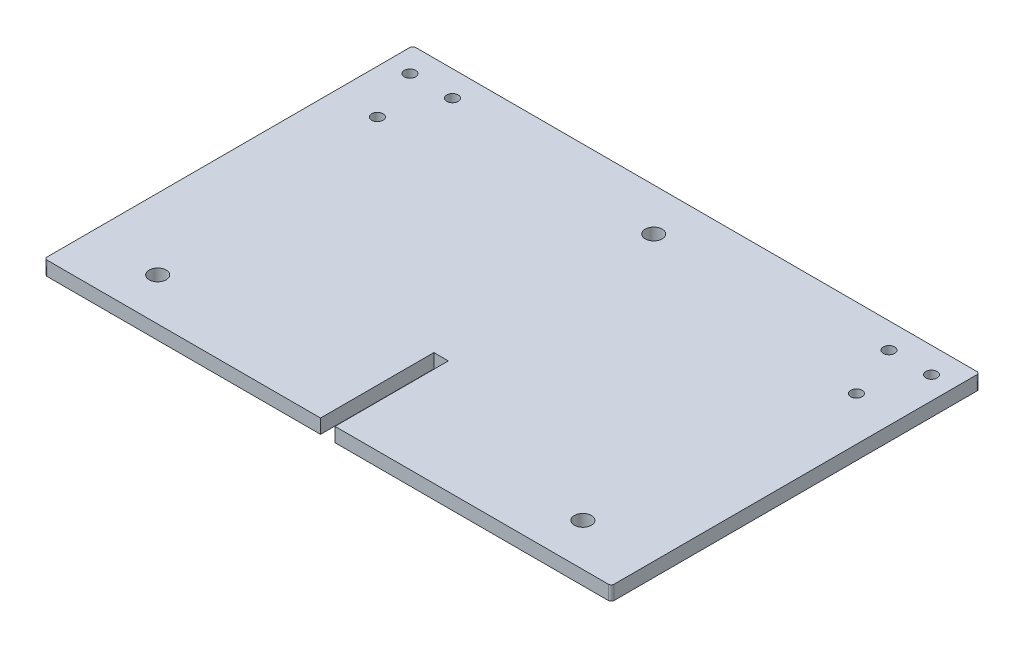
ISO-10303-21;
HEADER;
FILE_DESCRIPTION(('STEP AP214'),'2;1');
FILE_NAME('part.step','',(''),(''),'','','');
FILE_SCHEMA(('AUTOMOTIVE_DESIGN { 1 0 10303 214 1 1 1 1 }'));
ENDSEC;
DATA;
#1=APPLICATION_CONTEXT('core data for automotive mechanical design processes');
#2=APPLICATION_PROTOCOL_DEFINITION('international standard','automotive_design',2000,#1);
#3=PRODUCT_CONTEXT('',#1,'mechanical');
#4=PRODUCT('Part','Part','',(#3));
#5=PRODUCT_RELATED_PRODUCT_CATEGORY('part','',(#4));
#6=PRODUCT_DEFINITION_FORMATION('','',#4);
#7=PRODUCT_DEFINITION_CONTEXT('part definition',#1,'design');
#8=PRODUCT_DEFINITION('design','',#6,#7);
#9=PRODUCT_DEFINITION_SHAPE('','',#8);
#10=(LENGTH_UNIT() NAMED_UNIT(*) SI_UNIT(.MILLI.,.METRE.));
#11=(NAMED_UNIT(*) PLANE_ANGLE_UNIT() SI_UNIT($,.RADIAN.));
#12=(NAMED_UNIT(*) SI_UNIT($,.STERADIAN.) SOLID_ANGLE_UNIT());
#13=UNCERTAINTY_MEASURE_WITH_UNIT(LENGTH_MEASURE(1.E-05),#10,'distance_accuracy_value','');
#14=(GEOMETRIC_REPRESENTATION_CONTEXT(3) GLOBAL_UNCERTAINTY_ASSIGNED_CONTEXT((#13)) GLOBAL_UNIT_ASSIGNED_CONTEXT((#10,
#11,#12)) REPRESENTATION_CONTEXT('',''));
#15=CARTESIAN_POINT('',(0.,0.,0.));
#16=DIRECTION('',(0.,0.,1.));
#17=DIRECTION('',(1.,0.,0.));
#18=AXIS2_PLACEMENT_3D('',#15,#16,#17);
#19=CARTESIAN_POINT('',(0.,5.,0.));
#20=DIRECTION('',(0.,1.,0.));
#21=DIRECTION('',(0.,0.,1.));
#22=AXIS2_PLACEMENT_3D('',#19,#20,#21);
#23=PLANE('',#22);
#24=CARTESIAN_POINT('',(192.,5.,9.));
#25=DIRECTION('',(0.,1.,0.));
#26=DIRECTION('',(0.,0.,-1.));
#27=AXIS2_PLACEMENT_3D('',#24,#25,#26);
#28=CIRCLE('',#27,2.);
#29=CARTESIAN_POINT('',(192.,5.,7.));
#30=VERTEX_POINT('',#29);
#31=EDGE_CURVE('E282',#30,#30,#28,.T.);
#32=ORIENTED_EDGE('',*,*,#31,.F.);
#33=EDGE_LOOP('',(#32));
#34=FACE_BOUND('',#33,.T.);
#35=CARTESIAN_POINT('',(184.5,5.,28.));
#36=DIRECTION('',(0.,1.,0.));
#37=DIRECTION('',(0.,0.,-1.));
#38=AXIS2_PLACEMENT_3D('',#35,#36,#37);
#39=CIRCLE('',#38,2.00000000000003);
#40=CARTESIAN_POINT('',(184.5,5.,26.));
#41=VERTEX_POINT('',#40);
#42=EDGE_CURVE('E270',#41,#41,#39,.T.);
#43=ORIENTED_EDGE('',*,*,#42,.F.);
#44=EDGE_LOOP('',(#43));
#45=FACE_BOUND('',#44,.T.);
#46=CARTESIAN_POINT('',(25.,5.,115.));
#47=DIRECTION('',(0.,1.,0.));
#48=DIRECTION('',(0.,0.,1.));
#49=AXIS2_PLACEMENT_3D('',#46,#47,#48);
#50=CIRCLE('',#49,3.);
#51=CARTESIAN_POINT('',(25.,5.,118.));
#52=VERTEX_POINT('',#51);
#53=EDGE_CURVE('E258',#52,#52,#50,.T.);
#54=ORIENTED_EDGE('',*,*,#53,.F.);
#55=EDGE_LOOP('',(#54));
#56=FACE_BOUND('',#55,.T.);
#57=CARTESIAN_POINT('',(23.,5.,9.));
#58=DIRECTION('',(0.,1.,0.));
#59=DIRECTION('',(0.,0.,1.));
#60=AXIS2_PLACEMENT_3D('',#57,#58,#59);
#61=CIRCLE('',#60,2.);
#62=CARTESIAN_POINT('',(23.,5.,11.));
#63=VERTEX_POINT('',#62);
#64=EDGE_CURVE('E246',#63,#63,#61,.T.);
#65=ORIENTED_EDGE('',*,*,#64,.F.);
#66=EDGE_LOOP('',(#65));
#67=FACE_BOUND('',#66,.T.);
#68=DIRECTION('',(-1.,0.,0.));
#69=VECTOR('',#68,1.);
#70=CARTESIAN_POINT('',(0.,5.,0.));
#71=LINE('',#70,#69);
#72=CARTESIAN_POINT('',(199.,5.,0.));
#73=VERTEX_POINT('',#72);
#74=CARTESIAN_POINT('',(1.,5.,0.));
#75=VERTEX_POINT('',#74);
#76=EDGE_CURVE('E159',#73,#75,#71,.T.);
#77=ORIENTED_EDGE('',*,*,#76,.T.);
#78=CARTESIAN_POINT('',(1.,5.,1.));
#79=DIRECTION('',(0.,1.,0.));
#80=DIRECTION('',(0.,0.,1.));
#81=AXIS2_PLACEMENT_3D('',#78,#79,#80);
#82=CIRCLE('',#81,1.);
#83=CARTESIAN_POINT('',(0.,5.,1.));
#84=VERTEX_POINT('',#83);
#85=EDGE_CURVE('E208',#75,#84,#82,.T.);
#86=ORIENTED_EDGE('',*,*,#85,.T.);
#87=DIRECTION('',(0.,0.,1.));
#88=VECTOR('',#87,1.);
#89=CARTESIAN_POINT('',(0.,5.,0.));
#90=LINE('',#89,#88);
#91=CARTESIAN_POINT('',(0.,5.,129.));
#92=VERTEX_POINT('',#91);
#93=EDGE_CURVE('E133',#84,#92,#90,.T.);
#94=ORIENTED_EDGE('',*,*,#93,.T.);
#95=CARTESIAN_POINT('',(1.00000000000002,5.,129.));
#96=DIRECTION('',(0.,1.,0.));
#97=DIRECTION('',(0.,0.,1.));
#98=AXIS2_PLACEMENT_3D('',#95,#96,#97);
#99=CIRCLE('',#98,1.);
#100=CARTESIAN_POINT('',(1.00000000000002,5.,130.));
#101=VERTEX_POINT('',#100);
#102=EDGE_CURVE('E129',#92,#101,#99,.T.);
#103=ORIENTED_EDGE('',*,*,#102,.T.);
#104=DIRECTION('',(1.,0.,0.));
#105=VECTOR('',#104,1.);
#106=CARTESIAN_POINT('',(0.,5.,130.));
#107=LINE('',#106,#105);
#108=CARTESIAN_POINT('',(97.45,5.,130.));
#109=VERTEX_POINT('',#108);
#110=EDGE_CURVE('E120',#101,#109,#107,.T.);
#111=ORIENTED_EDGE('',*,*,#110,.T.);
#112=DIRECTION('',(0.,0.,-1.));
#113=VECTOR('',#112,1.);
#114=CARTESIAN_POINT('',(97.45,5.,130.));
#115=LINE('',#114,#113);
#116=CARTESIAN_POINT('',(97.45,5.,90.));
#117=VERTEX_POINT('',#116);
#118=EDGE_CURVE('E125',#109,#117,#115,.T.);
#119=ORIENTED_EDGE('',*,*,#118,.T.);
#120=DIRECTION('',(1.,0.,0.));
#121=VECTOR('',#120,1.);
#122=CARTESIAN_POINT('',(102.55,5.,90.));
#123=LINE('',#122,#121);
#124=CARTESIAN_POINT('',(102.55,5.,90.));
#125=VERTEX_POINT('',#124);
#126=EDGE_CURVE('E148',#117,#125,#123,.T.);
#127=ORIENTED_EDGE('',*,*,#126,.T.);
#128=DIRECTION('',(0.,0.,1.));
#129=VECTOR('',#128,1.);
#130=CARTESIAN_POINT('',(102.55,5.,130.));
#131=LINE('',#130,#129);
#132=CARTESIAN_POINT('',(102.55,5.,130.));
#133=VERTEX_POINT('',#132);
#134=EDGE_CURVE('E150',#125,#133,#131,.T.);
#135=ORIENTED_EDGE('',*,*,#134,.T.);
#136=DIRECTION('',(1.,0.,0.));
#137=VECTOR('',#136,1.);
#138=CARTESIAN_POINT('',(102.55,5.,130.));
#139=LINE('',#138,#137);
#140=CARTESIAN_POINT('',(199.,5.,130.));
#141=VERTEX_POINT('',#140);
#142=EDGE_CURVE('E155',#133,#141,#139,.T.);
#143=ORIENTED_EDGE('',*,*,#142,.T.);
#144=CARTESIAN_POINT('',(199.,5.,129.));
#145=DIRECTION('',(0.,1.,0.));
#146=DIRECTION('',(0.,0.,1.));
#147=AXIS2_PLACEMENT_3D('',#144,#145,#146);
#148=CIRCLE('',#147,1.);
#149=CARTESIAN_POINT('',(200.,5.,129.));
#150=VERTEX_POINT('',#149);
#151=EDGE_CURVE('E54',#141,#150,#148,.T.);
#152=ORIENTED_EDGE('',*,*,#151,.T.);
#153=DIRECTION('',(0.,0.,-1.));
#154=VECTOR('',#153,1.);
#155=CARTESIAN_POINT('',(200.,5.,0.));
#156=LINE('',#155,#154);
#157=CARTESIAN_POINT('',(200.,5.,1.));
#158=VERTEX_POINT('',#157);
#159=EDGE_CURVE('E157',#150,#158,#156,.T.);
#160=ORIENTED_EDGE('',*,*,#159,.T.);
#161=CARTESIAN_POINT('',(199.,5.,1.));
#162=DIRECTION('',(0.,1.,0.));
#163=DIRECTION('',(0.,0.,1.));
#164=AXIS2_PLACEMENT_3D('',#161,#162,#163);
#165=CIRCLE('',#164,1.);
#166=EDGE_CURVE('E205',#158,#73,#165,.T.);
#167=ORIENTED_EDGE('',*,*,#166,.T.);
#168=EDGE_LOOP('',(#77,#86,#94,#103,#111,#119,#127,#135,#143,#152,#160,#167));
#169=FACE_BOUND('',#168,.T.);
#170=CARTESIAN_POINT('',(8.,5.,9.));
#171=DIRECTION('',(0.,1.,0.));
#172=DIRECTION('',(0.,0.,1.));
#173=AXIS2_PLACEMENT_3D('',#170,#171,#172);
#174=CIRCLE('',#173,2.);
#175=CARTESIAN_POINT('',(8.,5.,11.));
#176=VERTEX_POINT('',#175);
#177=EDGE_CURVE('E165',#176,#176,#174,.T.);
#178=ORIENTED_EDGE('',*,*,#177,.F.);
#179=EDGE_LOOP('',(#178));
#180=FACE_BOUND('',#179,.T.);
#181=CARTESIAN_POINT('',(15.5,5.,28.));
#182=DIRECTION('',(0.,1.,0.));
#183=DIRECTION('',(0.,0.,1.));
#184=AXIS2_PLACEMENT_3D('',#181,#182,#183);
#185=CIRCLE('',#184,2.00000000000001);
#186=CARTESIAN_POINT('',(15.5,5.,30.));
#187=VERTEX_POINT('',#186);
#188=EDGE_CURVE('E252',#187,#187,#185,.T.);
#189=ORIENTED_EDGE('',*,*,#188,.F.);
#190=EDGE_LOOP('',(#189));
#191=FACE_BOUND('',#190,.T.);
#192=CARTESIAN_POINT('',(175.,5.,115.));
#193=DIRECTION('',(0.,1.,0.));
#194=DIRECTION('',(0.,0.,-1.));
#195=AXIS2_PLACEMENT_3D('',#192,#193,#194);
#196=CIRCLE('',#195,3.00000000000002);
#197=CARTESIAN_POINT('',(175.,5.,112.));
#198=VERTEX_POINT('',#197);
#199=EDGE_CURVE('E264',#198,#198,#196,.T.);
#200=ORIENTED_EDGE('',*,*,#199,.F.);
#201=EDGE_LOOP('',(#200));
#202=FACE_BOUND('',#201,.T.);
#203=CARTESIAN_POINT('',(177.,5.,9.));
#204=DIRECTION('',(0.,1.,0.));
#205=DIRECTION('',(0.,0.,-1.));
#206=AXIS2_PLACEMENT_3D('',#203,#204,#205);
#207=CIRCLE('',#206,2.);
#208=CARTESIAN_POINT('',(177.,5.,7.));
#209=VERTEX_POINT('',#208);
#210=EDGE_CURVE('E276',#209,#209,#207,.T.);
#211=ORIENTED_EDGE('',*,*,#210,.F.);
#212=EDGE_LOOP('',(#211));
#213=FACE_BOUND('',#212,.T.);
#214=CARTESIAN_POINT('',(100.,5.,15.));
#215=DIRECTION('',(0.,1.,0.));
#216=DIRECTION('',(0.,0.,1.));
#217=AXIS2_PLACEMENT_3D('',#214,#215,#216);
#218=CIRCLE('',#217,3.00000000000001);
#219=CARTESIAN_POINT('',(100.,5.,18.));
#220=VERTEX_POINT('',#219);
#221=EDGE_CURVE('E288',#220,#220,#218,.T.);
#222=ORIENTED_EDGE('',*,*,#221,.F.);
#223=EDGE_LOOP('',(#222));
#224=FACE_BOUND('',#223,.T.);
#225=ADVANCED_FACE('F33',(#34,#45,#56,#67,#169,#180,#191,#202,#213,#224),#23,.T.);
#226=CARTESIAN_POINT('',(0.,0.,0.));
#227=DIRECTION('',(0.,1.,0.));
#228=DIRECTION('',(0.,0.,1.));
#229=AXIS2_PLACEMENT_3D('',#226,#227,#228);
#230=PLANE('',#229);
#231=CARTESIAN_POINT('',(192.,0.,9.));
#232=DIRECTION('',(0.,1.,0.));
#233=DIRECTION('',(0.,0.,-1.));
#234=AXIS2_PLACEMENT_3D('',#231,#232,#233);
#235=CIRCLE('',#234,2.);
#236=CARTESIAN_POINT('',(192.,0.,7.));
#237=VERTEX_POINT('',#236);
#238=EDGE_CURVE('E285',#237,#237,#235,.T.);
#239=ORIENTED_EDGE('',*,*,#238,.T.);
#240=EDGE_LOOP('',(#239));
#241=FACE_BOUND('',#240,.T.);
#242=CARTESIAN_POINT('',(184.5,0.,28.));
#243=DIRECTION('',(0.,1.,0.));
#244=DIRECTION('',(0.,0.,-1.));
#245=AXIS2_PLACEMENT_3D('',#242,#243,#244);
#246=CIRCLE('',#245,2.00000000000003);
#247=CARTESIAN_POINT('',(184.5,0.,26.));
#248=VERTEX_POINT('',#247);
#249=EDGE_CURVE('E273',#248,#248,#246,.T.);
#250=ORIENTED_EDGE('',*,*,#249,.T.);
#251=EDGE_LOOP('',(#250));
#252=FACE_BOUND('',#251,.T.);
#253=CARTESIAN_POINT('',(25.,0.,115.));
#254=DIRECTION('',(0.,1.,0.));
#255=DIRECTION('',(0.,0.,1.));
#256=AXIS2_PLACEMENT_3D('',#253,#254,#255);
#257=CIRCLE('',#256,3.);
#258=CARTESIAN_POINT('',(25.,0.,118.));
#259=VERTEX_POINT('',#258);
#260=EDGE_CURVE('E261',#259,#259,#257,.T.);
#261=ORIENTED_EDGE('',*,*,#260,.T.);
#262=EDGE_LOOP('',(#261));
#263=FACE_BOUND('',#262,.T.);
#264=CARTESIAN_POINT('',(23.,0.,9.));
#265=DIRECTION('',(0.,1.,0.));
#266=DIRECTION('',(0.,0.,1.));
#267=AXIS2_PLACEMENT_3D('',#264,#265,#266);
#268=CIRCLE('',#267,2.);
#269=CARTESIAN_POINT('',(23.,0.,11.));
#270=VERTEX_POINT('',#269);
#271=EDGE_CURVE('E249',#270,#270,#268,.T.);
#272=ORIENTED_EDGE('',*,*,#271,.T.);
#273=EDGE_LOOP('',(#272));
#274=FACE_BOUND('',#273,.T.);
#275=DIRECTION('',(0.,0.,1.));
#276=VECTOR('',#275,1.);
#277=CARTESIAN_POINT('',(0.,0.,0.));
#278=LINE('',#277,#276);
#279=CARTESIAN_POINT('',(0.,0.,1.));
#280=VERTEX_POINT('',#279);
#281=CARTESIAN_POINT('',(0.,0.,129.));
#282=VERTEX_POINT('',#281);
#283=EDGE_CURVE('E162',#280,#282,#278,.T.);
#284=ORIENTED_EDGE('',*,*,#283,.F.);
#285=CARTESIAN_POINT('',(1.,0.,1.));
#286=DIRECTION('',(0.,1.,0.));
#287=DIRECTION('',(0.,0.,1.));
#288=AXIS2_PLACEMENT_3D('',#285,#286,#287);
#289=CIRCLE('',#288,1.);
#290=CARTESIAN_POINT('',(1.,0.,0.));
#291=VERTEX_POINT('',#290);
#292=EDGE_CURVE('E197',#280,#291,#289,.F.);
#293=ORIENTED_EDGE('',*,*,#292,.T.);
#294=DIRECTION('',(-1.,0.,0.));
#295=VECTOR('',#294,1.);
#296=CARTESIAN_POINT('',(0.,0.,0.));
#297=LINE('',#296,#295);
#298=CARTESIAN_POINT('',(199.,0.,0.));
#299=VERTEX_POINT('',#298);
#300=EDGE_CURVE('E178',#299,#291,#297,.T.);
#301=ORIENTED_EDGE('',*,*,#300,.F.);
#302=CARTESIAN_POINT('',(199.,0.,1.));
#303=DIRECTION('',(0.,1.,0.));
#304=DIRECTION('',(0.,0.,1.));
#305=AXIS2_PLACEMENT_3D('',#302,#303,#304);
#306=CIRCLE('',#305,1.);
#307=CARTESIAN_POINT('',(200.,0.,1.));
#308=VERTEX_POINT('',#307);
#309=EDGE_CURVE('E193',#299,#308,#306,.F.);
#310=ORIENTED_EDGE('',*,*,#309,.T.);
#311=DIRECTION('',(0.,0.,-1.));
#312=VECTOR('',#311,1.);
#313=CARTESIAN_POINT('',(200.,0.,0.));
#314=LINE('',#313,#312);
#315=CARTESIAN_POINT('',(200.,0.,129.));
#316=VERTEX_POINT('',#315);
#317=EDGE_CURVE('E176',#316,#308,#314,.T.);
#318=ORIENTED_EDGE('',*,*,#317,.F.);
#319=CARTESIAN_POINT('',(199.,0.,129.));
#320=DIRECTION('',(0.,1.,0.));
#321=DIRECTION('',(0.,0.,1.));
#322=AXIS2_PLACEMENT_3D('',#319,#320,#321);
#323=CIRCLE('',#322,1.);
#324=CARTESIAN_POINT('',(199.,0.,130.));
#325=VERTEX_POINT('',#324);
#326=EDGE_CURVE('E191',#316,#325,#323,.F.);
#327=ORIENTED_EDGE('',*,*,#326,.T.);
#328=DIRECTION('',(1.,0.,0.));
#329=VECTOR('',#328,1.);
#330=CARTESIAN_POINT('',(102.55,0.,130.));
#331=LINE('',#330,#329);
#332=CARTESIAN_POINT('',(102.55,0.,130.));
#333=VERTEX_POINT('',#332);
#334=EDGE_CURVE('E173',#333,#325,#331,.T.);
#335=ORIENTED_EDGE('',*,*,#334,.F.);
#336=DIRECTION('',(0.,0.,1.));
#337=VECTOR('',#336,1.);
#338=CARTESIAN_POINT('',(102.55,0.,130.));
#339=LINE('',#338,#337);
#340=CARTESIAN_POINT('',(102.55,0.,90.));
#341=VERTEX_POINT('',#340);
#342=EDGE_CURVE('E171',#341,#333,#339,.T.);
#343=ORIENTED_EDGE('',*,*,#342,.F.);
#344=DIRECTION('',(1.,0.,0.));
#345=VECTOR('',#344,1.);
#346=CARTESIAN_POINT('',(102.55,0.,90.));
#347=LINE('',#346,#345);
#348=CARTESIAN_POINT('',(97.45,0.,90.));
#349=VERTEX_POINT('',#348);
#350=EDGE_CURVE('E169',#349,#341,#347,.T.);
#351=ORIENTED_EDGE('',*,*,#350,.F.);
#352=DIRECTION('',(0.,0.,-1.));
#353=VECTOR('',#352,1.);
#354=CARTESIAN_POINT('',(97.45,0.,130.));
#355=LINE('',#354,#353);
#356=CARTESIAN_POINT('',(97.45,0.,130.));
#357=VERTEX_POINT('',#356);
#358=EDGE_CURVE('E167',#357,#349,#355,.T.);
#359=ORIENTED_EDGE('',*,*,#358,.F.);
#360=DIRECTION('',(1.,0.,0.));
#361=VECTOR('',#360,1.);
#362=CARTESIAN_POINT('',(0.,0.,130.));
#363=LINE('',#362,#361);
#364=CARTESIAN_POINT('',(1.00000000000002,0.,130.));
#365=VERTEX_POINT('',#364);
#366=EDGE_CURVE('E139',#365,#357,#363,.T.);
#367=ORIENTED_EDGE('',*,*,#366,.F.);
#368=CARTESIAN_POINT('',(1.00000000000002,0.,129.));
#369=DIRECTION('',(0.,1.,0.));
#370=DIRECTION('',(0.,0.,1.));
#371=AXIS2_PLACEMENT_3D('',#368,#369,#370);
#372=CIRCLE('',#371,1.);
#373=EDGE_CURVE('E195',#365,#282,#372,.F.);
#374=ORIENTED_EDGE('',*,*,#373,.T.);
#375=EDGE_LOOP('',(#284,#293,#301,#310,#318,#327,#335,#343,#351,#359,#367,#374));
#376=FACE_BOUND('',#375,.T.);
#377=CARTESIAN_POINT('',(8.,0.,9.));
#378=DIRECTION('',(0.,1.,0.));
#379=DIRECTION('',(0.,0.,1.));
#380=AXIS2_PLACEMENT_3D('',#377,#378,#379);
#381=CIRCLE('',#380,2.);
#382=CARTESIAN_POINT('',(8.,0.,11.));
#383=VERTEX_POINT('',#382);
#384=EDGE_CURVE('E243',#383,#383,#381,.T.);
#385=ORIENTED_EDGE('',*,*,#384,.T.);
#386=EDGE_LOOP('',(#385));
#387=FACE_BOUND('',#386,.T.);
#388=CARTESIAN_POINT('',(15.5,0.,28.));
#389=DIRECTION('',(0.,1.,0.));
#390=DIRECTION('',(0.,0.,1.));
#391=AXIS2_PLACEMENT_3D('',#388,#389,#390);
#392=CIRCLE('',#391,2.00000000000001);
#393=CARTESIAN_POINT('',(15.5,0.,30.));
#394=VERTEX_POINT('',#393);
#395=EDGE_CURVE('E255',#394,#394,#392,.T.);
#396=ORIENTED_EDGE('',*,*,#395,.T.);
#397=EDGE_LOOP('',(#396));
#398=FACE_BOUND('',#397,.T.);
#399=CARTESIAN_POINT('',(175.,0.,115.));
#400=DIRECTION('',(0.,1.,0.));
#401=DIRECTION('',(0.,0.,-1.));
#402=AXIS2_PLACEMENT_3D('',#399,#400,#401);
#403=CIRCLE('',#402,3.00000000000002);
#404=CARTESIAN_POINT('',(175.,0.,112.));
#405=VERTEX_POINT('',#404);
#406=EDGE_CURVE('E267',#405,#405,#403,.T.);
#407=ORIENTED_EDGE('',*,*,#406,.T.);
#408=EDGE_LOOP('',(#407));
#409=FACE_BOUND('',#408,.T.);
#410=CARTESIAN_POINT('',(177.,0.,9.));
#411=DIRECTION('',(0.,1.,0.));
#412=DIRECTION('',(0.,0.,-1.));
#413=AXIS2_PLACEMENT_3D('',#410,#411,#412);
#414=CIRCLE('',#413,2.);
#415=CARTESIAN_POINT('',(177.,0.,7.));
#416=VERTEX_POINT('',#415);
#417=EDGE_CURVE('E279',#416,#416,#414,.T.);
#418=ORIENTED_EDGE('',*,*,#417,.T.);
#419=EDGE_LOOP('',(#418));
#420=FACE_BOUND('',#419,.T.);
#421=CARTESIAN_POINT('',(100.,0.,15.));
#422=DIRECTION('',(0.,1.,0.));
#423=DIRECTION('',(0.,0.,1.));
#424=AXIS2_PLACEMENT_3D('',#421,#422,#423);
#425=CIRCLE('',#424,3.00000000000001);
#426=CARTESIAN_POINT('',(100.,0.,18.));
#427=VERTEX_POINT('',#426);
#428=EDGE_CURVE('E291',#427,#427,#425,.T.);
#429=ORIENTED_EDGE('',*,*,#428,.T.);
#430=EDGE_LOOP('',(#429));
#431=FACE_BOUND('',#430,.T.);
#432=ADVANCED_FACE('F220',(#241,#252,#263,#274,#376,#387,#398,#409,#420,#431),#230,.F.);
#433=CARTESIAN_POINT('',(0.,5.,0.));
#434=DIRECTION('',(1.,0.,0.));
#435=DIRECTION('',(0.,0.,-1.));
#436=AXIS2_PLACEMENT_3D('',#433,#434,#435);
#437=PLANE('',#436);
#438=ORIENTED_EDGE('',*,*,#93,.F.);
#439=DIRECTION('',(0.,-1.,0.));
#440=VECTOR('',#439,1.);
#441=CARTESIAN_POINT('',(0.,5.,1.));
#442=LINE('',#441,#440);
#443=EDGE_CURVE('E188',#84,#280,#442,.T.);
#444=ORIENTED_EDGE('',*,*,#443,.T.);
#445=ORIENTED_EDGE('',*,*,#283,.T.);
#446=DIRECTION('',(0.,-1.,0.));
#447=VECTOR('',#446,1.);
#448=CARTESIAN_POINT('',(0.,5.,129.));
#449=LINE('',#448,#447);
#450=EDGE_CURVE('E142',#282,#92,#449,.F.);
#451=ORIENTED_EDGE('',*,*,#450,.T.);
#452=EDGE_LOOP('',(#438,#444,#445,#451));
#453=FACE_BOUND('',#452,.T.);
#454=ADVANCED_FACE('F238',(#453),#437,.F.);
#455=CARTESIAN_POINT('',(0.,5.,130.));
#456=DIRECTION('',(0.,0.,-1.));
#457=DIRECTION('',(-1.,0.,0.));
#458=AXIS2_PLACEMENT_3D('',#455,#456,#457);
#459=PLANE('',#458);
#460=ORIENTED_EDGE('',*,*,#110,.F.);
#461=DIRECTION('',(0.,-1.,0.));
#462=VECTOR('',#461,1.);
#463=CARTESIAN_POINT('',(1.00000000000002,5.,130.));
#464=LINE('',#463,#462);
#465=EDGE_CURVE('E210',#101,#365,#464,.T.);
#466=ORIENTED_EDGE('',*,*,#465,.T.);
#467=ORIENTED_EDGE('',*,*,#366,.T.);
#468=DIRECTION('',(0.,-1.,0.));
#469=VECTOR('',#468,1.);
#470=CARTESIAN_POINT('',(97.45,5.,130.));
#471=LINE('',#470,#469);
#472=EDGE_CURVE('E136',#109,#357,#471,.T.);
#473=ORIENTED_EDGE('',*,*,#472,.F.);
#474=EDGE_LOOP('',(#460,#466,#467,#473));
#475=FACE_BOUND('',#474,.T.);
#476=ADVANCED_FACE('F137',(#475),#459,.F.);
#477=CARTESIAN_POINT('',(97.45,5.,130.));
#478=DIRECTION('',(-1.,0.,0.));
#479=DIRECTION('',(0.,0.,1.));
#480=AXIS2_PLACEMENT_3D('',#477,#478,#479);
#481=PLANE('',#480);
#482=ORIENTED_EDGE('',*,*,#358,.T.);
#483=DIRECTION('',(0.,-1.,0.));
#484=VECTOR('',#483,1.);
#485=CARTESIAN_POINT('',(97.45,5.,90.));
#486=LINE('',#485,#484);
#487=EDGE_CURVE('E143',#117,#349,#486,.T.);
#488=ORIENTED_EDGE('',*,*,#487,.F.);
#489=ORIENTED_EDGE('',*,*,#118,.F.);
#490=ORIENTED_EDGE('',*,*,#472,.T.);
#491=EDGE_LOOP('',(#482,#488,#489,#490));
#492=FACE_BOUND('',#491,.T.);
#493=ADVANCED_FACE('F145',(#492),#481,.F.);
#494=CARTESIAN_POINT('',(102.55,5.,90.));
#495=DIRECTION('',(0.,0.,-1.));
#496=DIRECTION('',(-1.,0.,0.));
#497=AXIS2_PLACEMENT_3D('',#494,#495,#496);
#498=PLANE('',#497);
#499=ORIENTED_EDGE('',*,*,#350,.T.);
#500=DIRECTION('',(0.,-1.,0.));
#501=VECTOR('',#500,1.);
#502=CARTESIAN_POINT('',(102.55,5.,90.));
#503=LINE('',#502,#501);
#504=EDGE_CURVE('E183',#125,#341,#503,.T.);
#505=ORIENTED_EDGE('',*,*,#504,.F.);
#506=ORIENTED_EDGE('',*,*,#126,.F.);
#507=ORIENTED_EDGE('',*,*,#487,.T.);
#508=EDGE_LOOP('',(#499,#505,#506,#507));
#509=FACE_BOUND('',#508,.T.);
#510=ADVANCED_FACE('F325',(#509),#498,.F.);
#511=CARTESIAN_POINT('',(102.55,5.,130.));
#512=DIRECTION('',(1.,0.,0.));
#513=DIRECTION('',(0.,0.,-1.));
#514=AXIS2_PLACEMENT_3D('',#511,#512,#513);
#515=PLANE('',#514);
#516=ORIENTED_EDGE('',*,*,#342,.T.);
#517=DIRECTION('',(0.,-1.,0.));
#518=VECTOR('',#517,1.);
#519=CARTESIAN_POINT('',(102.55,5.,130.));
#520=LINE('',#519,#518);
#521=EDGE_CURVE('E161',#133,#333,#520,.T.);
#522=ORIENTED_EDGE('',*,*,#521,.F.);
#523=ORIENTED_EDGE('',*,*,#134,.F.);
#524=ORIENTED_EDGE('',*,*,#504,.T.);
#525=EDGE_LOOP('',(#516,#522,#523,#524));
#526=FACE_BOUND('',#525,.T.);
#527=ADVANCED_FACE('F321',(#526),#515,.F.);
#528=CARTESIAN_POINT('',(102.55,5.,130.));
#529=DIRECTION('',(0.,0.,-1.));
#530=DIRECTION('',(-1.,0.,0.));
#531=AXIS2_PLACEMENT_3D('',#528,#529,#530);
#532=PLANE('',#531);
#533=ORIENTED_EDGE('',*,*,#334,.T.);
#534=DIRECTION('',(0.,-1.,0.));
#535=VECTOR('',#534,1.);
#536=CARTESIAN_POINT('',(199.,5.,130.));
#537=LINE('',#536,#535);
#538=EDGE_CURVE('E11',#325,#141,#537,.F.);
#539=ORIENTED_EDGE('',*,*,#538,.T.);
#540=ORIENTED_EDGE('',*,*,#142,.F.);
#541=ORIENTED_EDGE('',*,*,#521,.T.);
#542=EDGE_LOOP('',(#533,#539,#540,#541));
#543=FACE_BOUND('',#542,.T.);
#544=ADVANCED_FACE('F318',(#543),#532,.F.);
#545=CARTESIAN_POINT('',(200.,5.,0.));
#546=DIRECTION('',(-1.,0.,0.));
#547=DIRECTION('',(0.,0.,1.));
#548=AXIS2_PLACEMENT_3D('',#545,#546,#547);
#549=PLANE('',#548);
#550=ORIENTED_EDGE('',*,*,#317,.T.);
#551=DIRECTION('',(0.,-1.,0.));
#552=VECTOR('',#551,1.);
#553=CARTESIAN_POINT('',(200.,5.,1.));
#554=LINE('',#553,#552);
#555=EDGE_CURVE('E41',#308,#158,#554,.F.);
#556=ORIENTED_EDGE('',*,*,#555,.T.);
#557=ORIENTED_EDGE('',*,*,#159,.F.);
#558=DIRECTION('',(0.,-1.,0.));
#559=VECTOR('',#558,1.);
#560=CARTESIAN_POINT('',(200.,5.,129.));
#561=LINE('',#560,#559);
#562=EDGE_CURVE('E212',#150,#316,#561,.T.);
#563=ORIENTED_EDGE('',*,*,#562,.T.);
#564=EDGE_LOOP('',(#550,#556,#557,#563));
#565=FACE_BOUND('',#564,.T.);
#566=ADVANCED_FACE('F216',(#565),#549,.F.);
#567=CARTESIAN_POINT('',(0.,5.,0.));
#568=DIRECTION('',(0.,0.,1.));
#569=DIRECTION('',(1.,0.,0.));
#570=AXIS2_PLACEMENT_3D('',#567,#568,#569);
#571=PLANE('',#570);
#572=ORIENTED_EDGE('',*,*,#300,.T.);
#573=DIRECTION('',(0.,-1.,0.));
#574=VECTOR('',#573,1.);
#575=CARTESIAN_POINT('',(1.,5.,0.));
#576=LINE('',#575,#574);
#577=EDGE_CURVE('E202',#291,#75,#576,.F.);
#578=ORIENTED_EDGE('',*,*,#577,.T.);
#579=ORIENTED_EDGE('',*,*,#76,.F.);
#580=DIRECTION('',(0.,-1.,0.));
#581=VECTOR('',#580,1.);
#582=CARTESIAN_POINT('',(199.,5.,0.));
#583=LINE('',#582,#581);
#584=EDGE_CURVE('E199',#73,#299,#583,.T.);
#585=ORIENTED_EDGE('',*,*,#584,.T.);
#586=EDGE_LOOP('',(#572,#578,#579,#585));
#587=FACE_BOUND('',#586,.T.);
#588=ADVANCED_FACE('F230',(#587),#571,.F.);
#589=CARTESIAN_POINT('',(8.,5.,9.));
#590=DIRECTION('',(0.,-1.,0.));
#591=DIRECTION('',(0.,0.,-1.));
#592=AXIS2_PLACEMENT_3D('',#589,#590,#591);
#593=CYLINDRICAL_SURFACE('',#592,2.);
#594=ORIENTED_EDGE('',*,*,#177,.T.);
#595=EDGE_LOOP('',(#594));
#596=FACE_BOUND('',#595,.T.);
#597=ORIENTED_EDGE('',*,*,#384,.F.);
#598=EDGE_LOOP('',(#597));
#599=FACE_BOUND('',#598,.T.);
#600=ADVANCED_FACE('F311',(#596,#599),#593,.F.);
#601=CARTESIAN_POINT('',(23.,5.,9.));
#602=DIRECTION('',(0.,-1.,0.));
#603=DIRECTION('',(0.,0.,-1.));
#604=AXIS2_PLACEMENT_3D('',#601,#602,#603);
#605=CYLINDRICAL_SURFACE('',#604,2.);
#606=ORIENTED_EDGE('',*,*,#64,.T.);
#607=EDGE_LOOP('',(#606));
#608=FACE_BOUND('',#607,.T.);
#609=ORIENTED_EDGE('',*,*,#271,.F.);
#610=EDGE_LOOP('',(#609));
#611=FACE_BOUND('',#610,.T.);
#612=ADVANCED_FACE('F480',(#608,#611),#605,.F.);
#613=CARTESIAN_POINT('',(15.5,5.,28.));
#614=DIRECTION('',(0.,-1.,0.));
#615=DIRECTION('',(0.,0.,-1.));
#616=AXIS2_PLACEMENT_3D('',#613,#614,#615);
#617=CYLINDRICAL_SURFACE('',#616,2.00000000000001);
#618=ORIENTED_EDGE('',*,*,#188,.T.);
#619=EDGE_LOOP('',(#618));
#620=FACE_BOUND('',#619,.T.);
#621=ORIENTED_EDGE('',*,*,#395,.F.);
#622=EDGE_LOOP('',(#621));
#623=FACE_BOUND('',#622,.T.);
#624=ADVANCED_FACE('F470',(#620,#623),#617,.F.);
#625=CARTESIAN_POINT('',(25.,5.,115.));
#626=DIRECTION('',(0.,-1.,0.));
#627=DIRECTION('',(0.,0.,-1.));
#628=AXIS2_PLACEMENT_3D('',#625,#626,#627);
#629=CYLINDRICAL_SURFACE('',#628,3.);
#630=ORIENTED_EDGE('',*,*,#53,.T.);
#631=EDGE_LOOP('',(#630));
#632=FACE_BOUND('',#631,.T.);
#633=ORIENTED_EDGE('',*,*,#260,.F.);
#634=EDGE_LOOP('',(#633));
#635=FACE_BOUND('',#634,.T.);
#636=ADVANCED_FACE('F460',(#632,#635),#629,.F.);
#637=CARTESIAN_POINT('',(175.,5.,115.));
#638=DIRECTION('',(0.,-1.,0.));
#639=DIRECTION('',(0.,0.,-1.));
#640=AXIS2_PLACEMENT_3D('',#637,#638,#639);
#641=CYLINDRICAL_SURFACE('',#640,3.00000000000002);
#642=ORIENTED_EDGE('',*,*,#199,.T.);
#643=EDGE_LOOP('',(#642));
#644=FACE_BOUND('',#643,.T.);
#645=ORIENTED_EDGE('',*,*,#406,.F.);
#646=EDGE_LOOP('',(#645));
#647=FACE_BOUND('',#646,.T.);
#648=ADVANCED_FACE('F450',(#644,#647),#641,.F.);
#649=CARTESIAN_POINT('',(184.5,5.,28.));
#650=DIRECTION('',(0.,-1.,0.));
#651=DIRECTION('',(0.,0.,-1.));
#652=AXIS2_PLACEMENT_3D('',#649,#650,#651);
#653=CYLINDRICAL_SURFACE('',#652,2.00000000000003);
#654=ORIENTED_EDGE('',*,*,#42,.T.);
#655=EDGE_LOOP('',(#654));
#656=FACE_BOUND('',#655,.T.);
#657=ORIENTED_EDGE('',*,*,#249,.F.);
#658=EDGE_LOOP('',(#657));
#659=FACE_BOUND('',#658,.T.);
#660=ADVANCED_FACE('F440',(#656,#659),#653,.F.);
#661=CARTESIAN_POINT('',(177.,5.,9.));
#662=DIRECTION('',(0.,-1.,0.));
#663=DIRECTION('',(0.,0.,-1.));
#664=AXIS2_PLACEMENT_3D('',#661,#662,#663);
#665=CYLINDRICAL_SURFACE('',#664,2.);
#666=ORIENTED_EDGE('',*,*,#210,.T.);
#667=EDGE_LOOP('',(#666));
#668=FACE_BOUND('',#667,.T.);
#669=ORIENTED_EDGE('',*,*,#417,.F.);
#670=EDGE_LOOP('',(#669));
#671=FACE_BOUND('',#670,.T.);
#672=ADVANCED_FACE('F430',(#668,#671),#665,.F.);
#673=CARTESIAN_POINT('',(192.,5.,9.));
#674=DIRECTION('',(0.,-1.,0.));
#675=DIRECTION('',(0.,0.,-1.));
#676=AXIS2_PLACEMENT_3D('',#673,#674,#675);
#677=CYLINDRICAL_SURFACE('',#676,2.);
#678=ORIENTED_EDGE('',*,*,#31,.T.);
#679=EDGE_LOOP('',(#678));
#680=FACE_BOUND('',#679,.T.);
#681=ORIENTED_EDGE('',*,*,#238,.F.);
#682=EDGE_LOOP('',(#681));
#683=FACE_BOUND('',#682,.T.);
#684=ADVANCED_FACE('F421',(#680,#683),#677,.F.);
#685=CARTESIAN_POINT('',(100.,5.,15.));
#686=DIRECTION('',(0.,-1.,0.));
#687=DIRECTION('',(0.,0.,-1.));
#688=AXIS2_PLACEMENT_3D('',#685,#686,#687);
#689=CYLINDRICAL_SURFACE('',#688,3.00000000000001);
#690=ORIENTED_EDGE('',*,*,#221,.T.);
#691=EDGE_LOOP('',(#690));
#692=FACE_BOUND('',#691,.T.);
#693=ORIENTED_EDGE('',*,*,#428,.F.);
#694=EDGE_LOOP('',(#693));
#695=FACE_BOUND('',#694,.T.);
#696=ADVANCED_FACE('F297',(#692,#695),#689,.F.);
#697=CARTESIAN_POINT('',(1.,5.,1.));
#698=DIRECTION('',(0.,-1.,0.));
#699=DIRECTION('',(0.,0.,-1.));
#700=AXIS2_PLACEMENT_3D('',#697,#698,#699);
#701=CYLINDRICAL_SURFACE('',#700,1.);
#702=ORIENTED_EDGE('',*,*,#85,.F.);
#703=ORIENTED_EDGE('',*,*,#577,.F.);
#704=ORIENTED_EDGE('',*,*,#292,.F.);
#705=ORIENTED_EDGE('',*,*,#443,.F.);
#706=EDGE_LOOP('',(#702,#703,#704,#705));
#707=FACE_BOUND('',#706,.T.);
#708=ADVANCED_FACE('F236',(#707),#701,.T.);
#709=CARTESIAN_POINT('',(1.00000000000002,5.,129.));
#710=DIRECTION('',(0.,-1.,0.));
#711=DIRECTION('',(0.,0.,-1.));
#712=AXIS2_PLACEMENT_3D('',#709,#710,#711);
#713=CYLINDRICAL_SURFACE('',#712,1.);
#714=ORIENTED_EDGE('',*,*,#102,.F.);
#715=ORIENTED_EDGE('',*,*,#450,.F.);
#716=ORIENTED_EDGE('',*,*,#373,.F.);
#717=ORIENTED_EDGE('',*,*,#465,.F.);
#718=EDGE_LOOP('',(#714,#715,#716,#717));
#719=FACE_BOUND('',#718,.T.);
#720=ADVANCED_FACE('F241',(#719),#713,.T.);
#721=CARTESIAN_POINT('',(199.,5.,1.));
#722=DIRECTION('',(0.,-1.,0.));
#723=DIRECTION('',(0.,0.,-1.));
#724=AXIS2_PLACEMENT_3D('',#721,#722,#723);
#725=CYLINDRICAL_SURFACE('',#724,1.);
#726=ORIENTED_EDGE('',*,*,#166,.F.);
#727=ORIENTED_EDGE('',*,*,#555,.F.);
#728=ORIENTED_EDGE('',*,*,#309,.F.);
#729=ORIENTED_EDGE('',*,*,#584,.F.);
#730=EDGE_LOOP('',(#726,#727,#728,#729));
#731=FACE_BOUND('',#730,.T.);
#732=ADVANCED_FACE('F227',(#731),#725,.T.);
#733=CARTESIAN_POINT('',(199.,5.,129.));
#734=DIRECTION('',(0.,-1.,0.));
#735=DIRECTION('',(0.,0.,-1.));
#736=AXIS2_PLACEMENT_3D('',#733,#734,#735);
#737=CYLINDRICAL_SURFACE('',#736,1.);
#738=ORIENTED_EDGE('',*,*,#151,.F.);
#739=ORIENTED_EDGE('',*,*,#538,.F.);
#740=ORIENTED_EDGE('',*,*,#326,.F.);
#741=ORIENTED_EDGE('',*,*,#562,.F.);
#742=EDGE_LOOP('',(#738,#739,#740,#741));
#743=FACE_BOUND('',#742,.T.);
#744=ADVANCED_FACE('F35',(#743),#737,.T.);
#745=CLOSED_SHELL('',(#225,#432,#454,#476,#493,#510,#527,#544,#566,#588,#600,#612,#624,#636,
#648,#660,#672,#684,#696,#708,#720,#732,#744));
#746=MANIFOLD_SOLID_BREP('B2',#745);
#747=ADVANCED_BREP_SHAPE_REPRESENTATION('',(#18,#746),#14);
#748=SHAPE_DEFINITION_REPRESENTATION(#9,#747);
ENDSEC;
END-ISO-10303-21;
